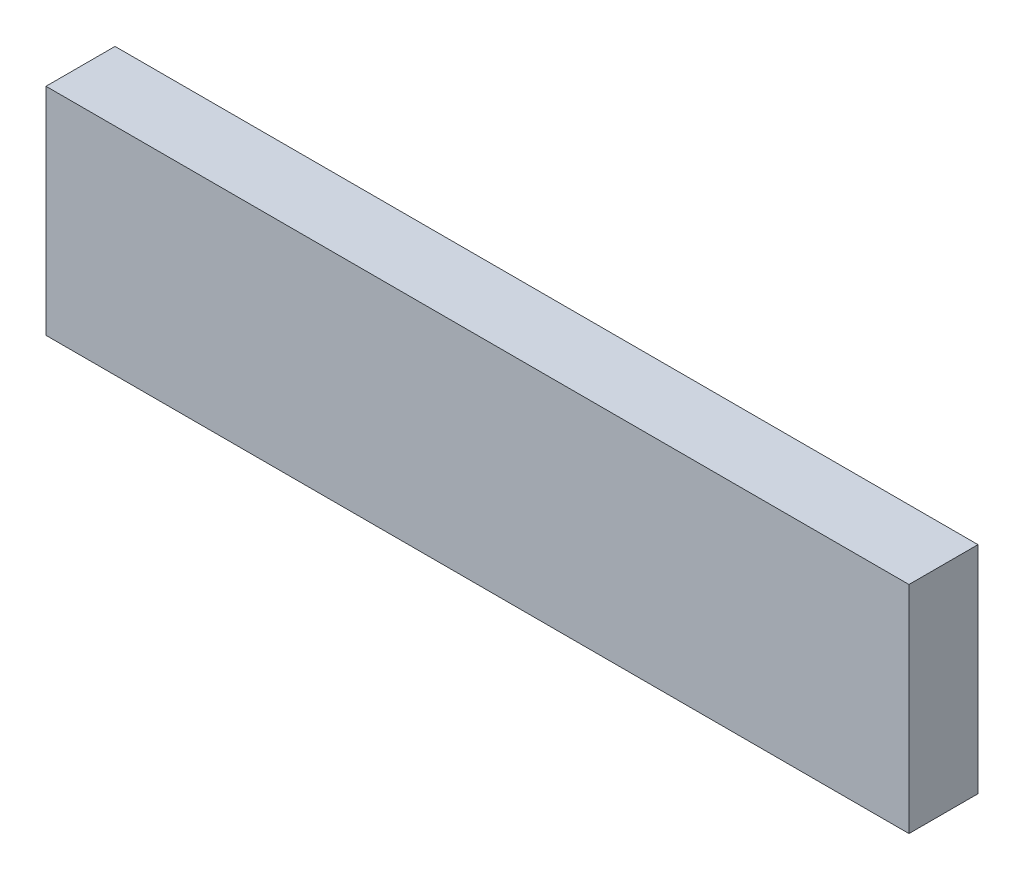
from build123d import *

# Parameters (mm, degrees)
ESQUISSE1_W      = 8
ESQUISSE1_H      = 25
EXTRUSION1_DEPTH = 100


with BuildPart() as part:
    # Esquisse1 → Extrusion1 (new body)
    with BuildSketch(Plane(origin=(0, 0, 0), x_dir=(0, 0, -1), z_dir=(1, 0, 0))):
        with Locations((4, 12.5)):
            Rectangle(ESQUISSE1_W, ESQUISSE1_H)
    extrude(amount=EXTRUSION1_DEPTH)


solid = part.part
